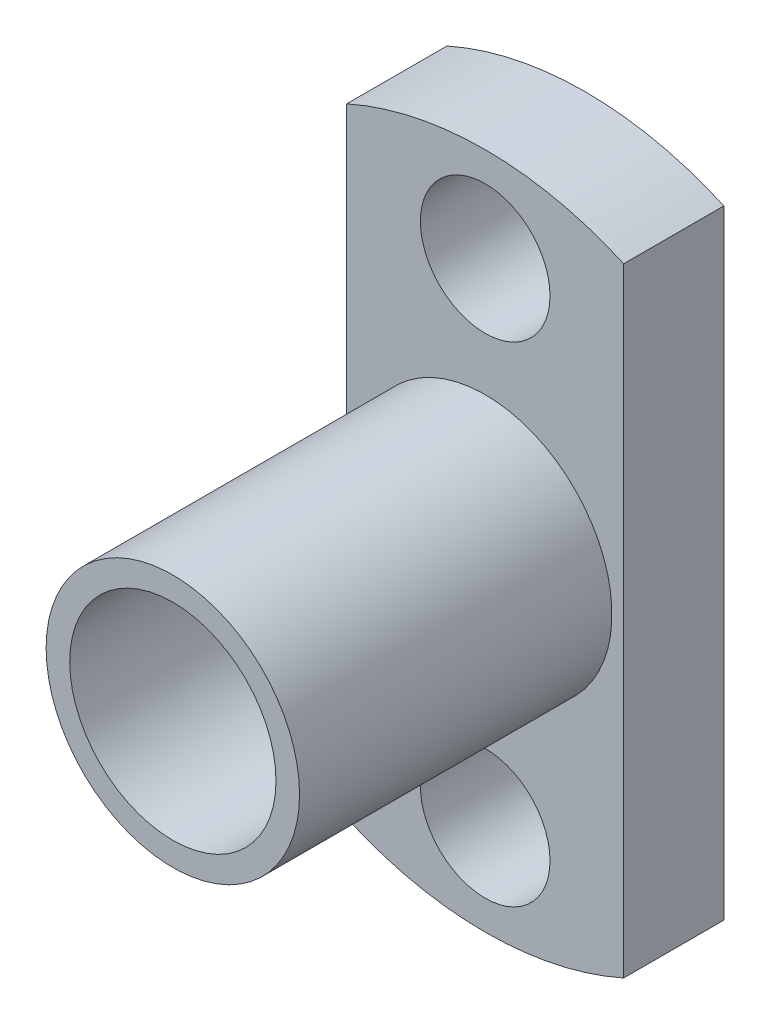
ISO-10303-21;
HEADER;
FILE_DESCRIPTION(('STEP AP214'),'2;1');
FILE_NAME('part.step','',(''),(''),'','','');
FILE_SCHEMA(('AUTOMOTIVE_DESIGN { 1 0 10303 214 1 1 1 1 }'));
ENDSEC;
DATA;
#1=APPLICATION_CONTEXT('core data for automotive mechanical design processes');
#2=APPLICATION_PROTOCOL_DEFINITION('international standard','automotive_design',2000,#1);
#3=PRODUCT_CONTEXT('',#1,'mechanical');
#4=PRODUCT('Part','Part','',(#3));
#5=PRODUCT_RELATED_PRODUCT_CATEGORY('part','',(#4));
#6=PRODUCT_DEFINITION_FORMATION('','',#4);
#7=PRODUCT_DEFINITION_CONTEXT('part definition',#1,'design');
#8=PRODUCT_DEFINITION('design','',#6,#7);
#9=PRODUCT_DEFINITION_SHAPE('','',#8);
#10=(LENGTH_UNIT() NAMED_UNIT(*) SI_UNIT(.MILLI.,.METRE.));
#11=(NAMED_UNIT(*) PLANE_ANGLE_UNIT() SI_UNIT($,.RADIAN.));
#12=(NAMED_UNIT(*) SI_UNIT($,.STERADIAN.) SOLID_ANGLE_UNIT());
#13=UNCERTAINTY_MEASURE_WITH_UNIT(LENGTH_MEASURE(1.E-05),#10,'distance_accuracy_value','');
#14=(GEOMETRIC_REPRESENTATION_CONTEXT(3) GLOBAL_UNCERTAINTY_ASSIGNED_CONTEXT((#13)) GLOBAL_UNIT_ASSIGNED_CONTEXT((#10,
#11,#12)) REPRESENTATION_CONTEXT('',''));
#15=CARTESIAN_POINT('',(0.,0.,0.));
#16=DIRECTION('',(0.,0.,1.));
#17=DIRECTION('',(1.,0.,0.));
#18=AXIS2_PLACEMENT_3D('',#15,#16,#17);
#19=CARTESIAN_POINT('',(0.,0.,3.7));
#20=DIRECTION('',(0.,0.,1.));
#21=DIRECTION('',(1.,0.,0.));
#22=AXIS2_PLACEMENT_3D('',#19,#20,#21);
#23=PLANE('',#22);
#24=CARTESIAN_POINT('',(0.,0.,3.7));
#25=DIRECTION('',(0.,0.,1.));
#26=DIRECTION('',(1.,0.,0.));
#27=AXIS2_PLACEMENT_3D('',#24,#25,#26);
#28=CIRCLE('',#27,1.75);
#29=CARTESIAN_POINT('',(1.75,0.,3.7));
#30=VERTEX_POINT('',#29);
#31=EDGE_CURVE('E119',#30,#30,#28,.T.);
#32=ORIENTED_EDGE('',*,*,#31,.T.);
#33=EDGE_LOOP('',(#32));
#34=FACE_BOUND('',#33,.T.);
#35=CARTESIAN_POINT('',(0.,0.,3.7));
#36=DIRECTION('',(0.,0.,1.));
#37=DIRECTION('',(1.,0.,0.));
#38=AXIS2_PLACEMENT_3D('',#35,#36,#37);
#39=CIRCLE('',#38,0.19);
#40=CARTESIAN_POINT('',(0.19,0.,3.7));
#41=VERTEX_POINT('',#40);
#42=EDGE_CURVE('E126',#41,#41,#39,.T.);
#43=ORIENTED_EDGE('',*,*,#42,.F.);
#44=EDGE_LOOP('',(#43));
#45=FACE_BOUND('',#44,.T.);
#46=ADVANCED_FACE('F35',(#34,#45),#23,.T.);
#47=CARTESIAN_POINT('',(0.,0.,1.7));
#48=DIRECTION('',(0.,0.,-1.));
#49=DIRECTION('',(-1.,0.,0.));
#50=AXIS2_PLACEMENT_3D('',#47,#48,#49);
#51=PLANE('',#50);
#52=CARTESIAN_POINT('',(0.,-4.15,1.7));
#53=DIRECTION('',(0.,0.,1.));
#54=DIRECTION('',(1.,0.,0.));
#55=AXIS2_PLACEMENT_3D('',#52,#53,#54);
#56=CIRCLE('',#55,1.1);
#57=CARTESIAN_POINT('',(1.1,-4.15,1.7));
#58=VERTEX_POINT('',#57);
#59=EDGE_CURVE('E138',#58,#58,#56,.T.);
#60=ORIENTED_EDGE('',*,*,#59,.F.);
#61=EDGE_LOOP('',(#60));
#62=FACE_BOUND('',#61,.T.);
#63=CARTESIAN_POINT('',(0.,4.15,1.7));
#64=DIRECTION('',(0.,0.,1.));
#65=DIRECTION('',(1.,0.,0.));
#66=AXIS2_PLACEMENT_3D('',#63,#64,#65);
#67=CIRCLE('',#66,1.1);
#68=CARTESIAN_POINT('',(1.1,4.15,1.7));
#69=VERTEX_POINT('',#68);
#70=EDGE_CURVE('E132',#69,#69,#67,.T.);
#71=ORIENTED_EDGE('',*,*,#70,.F.);
#72=EDGE_LOOP('',(#71));
#73=FACE_BOUND('',#72,.T.);
#74=CARTESIAN_POINT('',(0.,0.,1.7));
#75=DIRECTION('',(0.,0.,1.));
#76=DIRECTION('',(-1.,0.,0.));
#77=AXIS2_PLACEMENT_3D('',#74,#75,#76);
#78=CIRCLE('',#77,5.75000000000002);
#79=CARTESIAN_POINT('',(2.35,5.24785670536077,1.7));
#80=VERTEX_POINT('',#79);
#81=CARTESIAN_POINT('',(-2.35,5.24785670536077,1.7));
#82=VERTEX_POINT('',#81);
#83=EDGE_CURVE('E88',#80,#82,#78,.T.);
#84=ORIENTED_EDGE('',*,*,#83,.T.);
#85=DIRECTION('',(0.,-1.,0.));
#86=VECTOR('',#85,1.);
#87=CARTESIAN_POINT('',(-2.35,5.24785670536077,1.7));
#88=LINE('',#87,#86);
#89=CARTESIAN_POINT('',(-2.35,-5.24785670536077,1.7));
#90=VERTEX_POINT('',#89);
#91=EDGE_CURVE('E81',#82,#90,#88,.T.);
#92=ORIENTED_EDGE('',*,*,#91,.T.);
#93=CARTESIAN_POINT('',(0.,0.,1.7));
#94=DIRECTION('',(0.,0.,1.));
#95=DIRECTION('',(1.,0.,0.));
#96=AXIS2_PLACEMENT_3D('',#93,#94,#95);
#97=CIRCLE('',#96,5.75);
#98=CARTESIAN_POINT('',(2.35,-5.24785670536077,1.7));
#99=VERTEX_POINT('',#98);
#100=EDGE_CURVE('E85',#90,#99,#97,.T.);
#101=ORIENTED_EDGE('',*,*,#100,.T.);
#102=DIRECTION('',(0.,1.,0.));
#103=VECTOR('',#102,1.);
#104=CARTESIAN_POINT('',(2.35,0.,1.7));
#105=LINE('',#104,#103);
#106=EDGE_CURVE('E52',#99,#80,#105,.T.);
#107=ORIENTED_EDGE('',*,*,#106,.T.);
#108=EDGE_LOOP('',(#84,#92,#101,#107));
#109=FACE_BOUND('',#108,.T.);
#110=CARTESIAN_POINT('',(0.,0.,1.7));
#111=DIRECTION('',(0.,0.,-1.));
#112=DIRECTION('',(-1.,0.,0.));
#113=AXIS2_PLACEMENT_3D('',#110,#111,#112);
#114=CIRCLE('',#113,2.15);
#115=CARTESIAN_POINT('',(-2.15,0.,1.7));
#116=VERTEX_POINT('',#115);
#117=EDGE_CURVE('E11',#116,#116,#114,.F.);
#118=ORIENTED_EDGE('',*,*,#117,.F.);
#119=EDGE_LOOP('',(#118));
#120=FACE_BOUND('',#119,.T.);
#121=ADVANCED_FACE('F82',(#62,#73,#109,#120),#51,.F.);
#122=CARTESIAN_POINT('',(0.,0.,1.7));
#123=DIRECTION('',(0.,0.,-1.));
#124=DIRECTION('',(-1.,0.,0.));
#125=AXIS2_PLACEMENT_3D('',#122,#123,#124);
#126=CYLINDRICAL_SURFACE('',#125,5.75000000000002);
#127=CARTESIAN_POINT('',(0.,0.,0.));
#128=DIRECTION('',(0.,0.,1.));
#129=DIRECTION('',(-1.,0.,0.));
#130=AXIS2_PLACEMENT_3D('',#127,#128,#129);
#131=CIRCLE('',#130,5.75000000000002);
#132=CARTESIAN_POINT('',(2.35,5.24785670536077,0.));
#133=VERTEX_POINT('',#132);
#134=CARTESIAN_POINT('',(-2.35,5.24785670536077,0.));
#135=VERTEX_POINT('',#134);
#136=EDGE_CURVE('E104',#133,#135,#131,.T.);
#137=ORIENTED_EDGE('',*,*,#136,.T.);
#138=DIRECTION('',(0.,0.,-1.));
#139=VECTOR('',#138,1.);
#140=CARTESIAN_POINT('',(-2.35,5.24785670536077,1.7));
#141=LINE('',#140,#139);
#142=EDGE_CURVE('E44',#82,#135,#141,.T.);
#143=ORIENTED_EDGE('',*,*,#142,.F.);
#144=ORIENTED_EDGE('',*,*,#83,.F.);
#145=DIRECTION('',(0.,0.,-1.));
#146=VECTOR('',#145,1.);
#147=CARTESIAN_POINT('',(2.35,5.24785670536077,1.7));
#148=LINE('',#147,#146);
#149=EDGE_CURVE('E100',#80,#133,#148,.T.);
#150=ORIENTED_EDGE('',*,*,#149,.T.);
#151=EDGE_LOOP('',(#137,#143,#144,#150));
#152=FACE_BOUND('',#151,.T.);
#153=ADVANCED_FACE('F37',(#152),#126,.T.);
#154=CARTESIAN_POINT('',(-2.35,5.24785670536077,1.7));
#155=DIRECTION('',(1.,0.,0.));
#156=DIRECTION('',(0.,0.,-1.));
#157=AXIS2_PLACEMENT_3D('',#154,#155,#156);
#158=PLANE('',#157);
#159=DIRECTION('',(0.,-1.,0.));
#160=VECTOR('',#159,1.);
#161=CARTESIAN_POINT('',(-2.35,5.24785670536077,0.));
#162=LINE('',#161,#160);
#163=CARTESIAN_POINT('',(-2.35,-5.24785670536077,0.));
#164=VERTEX_POINT('',#163);
#165=EDGE_CURVE('E94',#135,#164,#162,.T.);
#166=ORIENTED_EDGE('',*,*,#165,.T.);
#167=DIRECTION('',(0.,0.,-1.));
#168=VECTOR('',#167,1.);
#169=CARTESIAN_POINT('',(-2.35,-5.24785670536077,1.7));
#170=LINE('',#169,#168);
#171=EDGE_CURVE('E92',#90,#164,#170,.T.);
#172=ORIENTED_EDGE('',*,*,#171,.F.);
#173=ORIENTED_EDGE('',*,*,#91,.F.);
#174=ORIENTED_EDGE('',*,*,#142,.T.);
#175=EDGE_LOOP('',(#166,#172,#173,#174));
#176=FACE_BOUND('',#175,.T.);
#177=ADVANCED_FACE('F93',(#176),#158,.F.);
#178=CARTESIAN_POINT('',(0.,0.,1.7));
#179=DIRECTION('',(0.,0.,-1.));
#180=DIRECTION('',(-1.,0.,0.));
#181=AXIS2_PLACEMENT_3D('',#178,#179,#180);
#182=CYLINDRICAL_SURFACE('',#181,5.75);
#183=CARTESIAN_POINT('',(0.,0.,0.));
#184=DIRECTION('',(0.,0.,1.));
#185=DIRECTION('',(1.,0.,0.));
#186=AXIS2_PLACEMENT_3D('',#183,#184,#185);
#187=CIRCLE('',#186,5.75);
#188=CARTESIAN_POINT('',(2.35,-5.24785670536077,0.));
#189=VERTEX_POINT('',#188);
#190=EDGE_CURVE('E109',#164,#189,#187,.T.);
#191=ORIENTED_EDGE('',*,*,#190,.T.);
#192=DIRECTION('',(0.,0.,-1.));
#193=VECTOR('',#192,1.);
#194=CARTESIAN_POINT('',(2.35,-5.24785670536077,1.7));
#195=LINE('',#194,#193);
#196=EDGE_CURVE('E96',#99,#189,#195,.T.);
#197=ORIENTED_EDGE('',*,*,#196,.F.);
#198=ORIENTED_EDGE('',*,*,#100,.F.);
#199=ORIENTED_EDGE('',*,*,#171,.T.);
#200=EDGE_LOOP('',(#191,#197,#198,#199));
#201=FACE_BOUND('',#200,.T.);
#202=ADVANCED_FACE('F98',(#201),#182,.T.);
#203=CARTESIAN_POINT('',(2.35,0.,1.7));
#204=DIRECTION('',(-1.,0.,0.));
#205=DIRECTION('',(0.,0.,1.));
#206=AXIS2_PLACEMENT_3D('',#203,#204,#205);
#207=PLANE('',#206);
#208=DIRECTION('',(0.,1.,0.));
#209=VECTOR('',#208,1.);
#210=CARTESIAN_POINT('',(2.35,0.,0.));
#211=LINE('',#210,#209);
#212=EDGE_CURVE('E69',#189,#133,#211,.T.);
#213=ORIENTED_EDGE('',*,*,#212,.T.);
#214=ORIENTED_EDGE('',*,*,#149,.F.);
#215=ORIENTED_EDGE('',*,*,#106,.F.);
#216=ORIENTED_EDGE('',*,*,#196,.T.);
#217=EDGE_LOOP('',(#213,#214,#215,#216));
#218=FACE_BOUND('',#217,.T.);
#219=ADVANCED_FACE('F115',(#218),#207,.F.);
#220=CARTESIAN_POINT('',(0.,0.,0.));
#221=DIRECTION('',(0.,0.,-1.));
#222=DIRECTION('',(-1.,0.,0.));
#223=AXIS2_PLACEMENT_3D('',#220,#221,#222);
#224=PLANE('',#223);
#225=CARTESIAN_POINT('',(0.,0.,0.));
#226=DIRECTION('',(0.,0.,-1.));
#227=DIRECTION('',(-1.,0.,0.));
#228=AXIS2_PLACEMENT_3D('',#225,#226,#227);
#229=CIRCLE('',#228,0.19);
#230=CARTESIAN_POINT('',(-0.19,0.,0.));
#231=VERTEX_POINT('',#230);
#232=EDGE_CURVE('E144',#231,#231,#229,.T.);
#233=ORIENTED_EDGE('',*,*,#232,.F.);
#234=EDGE_LOOP('',(#233));
#235=FACE_BOUND('',#234,.T.);
#236=CARTESIAN_POINT('',(0.,-4.15,0.));
#237=DIRECTION('',(0.,0.,1.));
#238=DIRECTION('',(1.,0.,0.));
#239=AXIS2_PLACEMENT_3D('',#236,#237,#238);
#240=CIRCLE('',#239,1.1);
#241=CARTESIAN_POINT('',(1.1,-4.15,0.));
#242=VERTEX_POINT('',#241);
#243=EDGE_CURVE('E135',#242,#242,#240,.T.);
#244=ORIENTED_EDGE('',*,*,#243,.T.);
#245=EDGE_LOOP('',(#244));
#246=FACE_BOUND('',#245,.T.);
#247=CARTESIAN_POINT('',(0.,4.15,0.));
#248=DIRECTION('',(0.,0.,1.));
#249=DIRECTION('',(1.,0.,0.));
#250=AXIS2_PLACEMENT_3D('',#247,#248,#249);
#251=CIRCLE('',#250,1.1);
#252=CARTESIAN_POINT('',(1.1,4.15,0.));
#253=VERTEX_POINT('',#252);
#254=EDGE_CURVE('E129',#253,#253,#251,.T.);
#255=ORIENTED_EDGE('',*,*,#254,.T.);
#256=EDGE_LOOP('',(#255));
#257=FACE_BOUND('',#256,.T.);
#258=ORIENTED_EDGE('',*,*,#136,.F.);
#259=ORIENTED_EDGE('',*,*,#212,.F.);
#260=ORIENTED_EDGE('',*,*,#190,.F.);
#261=ORIENTED_EDGE('',*,*,#165,.F.);
#262=EDGE_LOOP('',(#258,#259,#260,#261));
#263=FACE_BOUND('',#262,.T.);
#264=ADVANCED_FACE('F114',(#235,#246,#257,#263),#224,.T.);
#265=CARTESIAN_POINT('',(0.,0.,7.));
#266=DIRECTION('',(0.,0.,-1.));
#267=DIRECTION('',(-1.,0.,0.));
#268=AXIS2_PLACEMENT_3D('',#265,#266,#267);
#269=CYLINDRICAL_SURFACE('',#268,2.15);
#270=CARTESIAN_POINT('',(0.,0.,7.));
#271=DIRECTION('',(0.,0.,1.));
#272=DIRECTION('',(1.,0.,0.));
#273=AXIS2_PLACEMENT_3D('',#270,#271,#272);
#274=CIRCLE('',#273,2.15);
#275=CARTESIAN_POINT('',(2.15,0.,7.));
#276=VERTEX_POINT('',#275);
#277=EDGE_CURVE('E107',#276,#276,#274,.T.);
#278=ORIENTED_EDGE('',*,*,#277,.F.);
#279=EDGE_LOOP('',(#278));
#280=FACE_BOUND('',#279,.T.);
#281=ORIENTED_EDGE('',*,*,#117,.T.);
#282=EDGE_LOOP('',(#281));
#283=FACE_BOUND('',#282,.T.);
#284=ADVANCED_FACE('F161',(#280,#283),#269,.T.);
#285=CARTESIAN_POINT('',(0.,0.,7.));
#286=DIRECTION('',(0.,0.,1.));
#287=DIRECTION('',(1.,0.,0.));
#288=AXIS2_PLACEMENT_3D('',#285,#286,#287);
#289=PLANE('',#288);
#290=CARTESIAN_POINT('',(0.,0.,7.));
#291=DIRECTION('',(0.,0.,1.));
#292=DIRECTION('',(1.,0.,0.));
#293=AXIS2_PLACEMENT_3D('',#290,#291,#292);
#294=CIRCLE('',#293,1.75);
#295=CARTESIAN_POINT('',(1.75,0.,7.));
#296=VERTEX_POINT('',#295);
#297=EDGE_CURVE('E120',#296,#296,#294,.T.);
#298=ORIENTED_EDGE('',*,*,#297,.F.);
#299=EDGE_LOOP('',(#298));
#300=FACE_BOUND('',#299,.T.);
#301=ORIENTED_EDGE('',*,*,#277,.T.);
#302=EDGE_LOOP('',(#301));
#303=FACE_BOUND('',#302,.T.);
#304=ADVANCED_FACE('F215',(#300,#303),#289,.T.);
#305=CARTESIAN_POINT('',(0.,0.,3.7));
#306=DIRECTION('',(0.,0.,1.));
#307=DIRECTION('',(1.,0.,0.));
#308=AXIS2_PLACEMENT_3D('',#305,#306,#307);
#309=CYLINDRICAL_SURFACE('',#308,1.75);
#310=ORIENTED_EDGE('',*,*,#31,.F.);
#311=EDGE_LOOP('',(#310));
#312=FACE_BOUND('',#311,.T.);
#313=ORIENTED_EDGE('',*,*,#297,.T.);
#314=EDGE_LOOP('',(#313));
#315=FACE_BOUND('',#314,.T.);
#316=ADVANCED_FACE('F222',(#312,#315),#309,.F.);
#317=CARTESIAN_POINT('',(0.,0.,4.7));
#318=DIRECTION('',(0.,0.,-1.));
#319=DIRECTION('',(-1.,0.,0.));
#320=AXIS2_PLACEMENT_3D('',#317,#318,#319);
#321=CYLINDRICAL_SURFACE('',#320,0.19);
#322=CARTESIAN_POINT('',(0.,0.,4.7));
#323=DIRECTION('',(0.,0.,1.));
#324=DIRECTION('',(1.,0.,0.));
#325=AXIS2_PLACEMENT_3D('',#322,#323,#324);
#326=CIRCLE('',#325,0.19);
#327=CARTESIAN_POINT('',(0.19,0.,4.7));
#328=VERTEX_POINT('',#327);
#329=EDGE_CURVE('E123',#328,#328,#326,.T.);
#330=ORIENTED_EDGE('',*,*,#329,.F.);
#331=EDGE_LOOP('',(#330));
#332=FACE_BOUND('',#331,.T.);
#333=ORIENTED_EDGE('',*,*,#42,.T.);
#334=EDGE_LOOP('',(#333));
#335=FACE_BOUND('',#334,.T.);
#336=ADVANCED_FACE('F229',(#332,#335),#321,.T.);
#337=CARTESIAN_POINT('',(0.,0.,4.7));
#338=DIRECTION('',(0.,0.,1.));
#339=DIRECTION('',(1.,0.,0.));
#340=AXIS2_PLACEMENT_3D('',#337,#338,#339);
#341=PLANE('',#340);
#342=ORIENTED_EDGE('',*,*,#329,.T.);
#343=EDGE_LOOP('',(#342));
#344=FACE_BOUND('',#343,.T.);
#345=ADVANCED_FACE('F170',(#344),#341,.T.);
#346=CARTESIAN_POINT('',(0.,4.15,0.));
#347=DIRECTION('',(0.,0.,1.));
#348=DIRECTION('',(1.,0.,0.));
#349=AXIS2_PLACEMENT_3D('',#346,#347,#348);
#350=CYLINDRICAL_SURFACE('',#349,1.1);
#351=ORIENTED_EDGE('',*,*,#254,.F.);
#352=EDGE_LOOP('',(#351));
#353=FACE_BOUND('',#352,.T.);
#354=ORIENTED_EDGE('',*,*,#70,.T.);
#355=EDGE_LOOP('',(#354));
#356=FACE_BOUND('',#355,.T.);
#357=ADVANCED_FACE('F167',(#353,#356),#350,.F.);
#358=CARTESIAN_POINT('',(0.,-4.15,0.));
#359=DIRECTION('',(0.,0.,1.));
#360=DIRECTION('',(1.,0.,0.));
#361=AXIS2_PLACEMENT_3D('',#358,#359,#360);
#362=CYLINDRICAL_SURFACE('',#361,1.1);
#363=ORIENTED_EDGE('',*,*,#243,.F.);
#364=EDGE_LOOP('',(#363));
#365=FACE_BOUND('',#364,.T.);
#366=ORIENTED_EDGE('',*,*,#59,.T.);
#367=EDGE_LOOP('',(#366));
#368=FACE_BOUND('',#367,.T.);
#369=ADVANCED_FACE('F155',(#365,#368),#362,.F.);
#370=CARTESIAN_POINT('',(0.,0.,1.));
#371=DIRECTION('',(0.,0.,-1.));
#372=DIRECTION('',(-1.,0.,0.));
#373=AXIS2_PLACEMENT_3D('',#370,#371,#372);
#374=CYLINDRICAL_SURFACE('',#373,0.19);
#375=CARTESIAN_POINT('',(0.,0.,1.));
#376=DIRECTION('',(0.,0.,-1.));
#377=DIRECTION('',(-1.,0.,0.));
#378=AXIS2_PLACEMENT_3D('',#375,#376,#377);
#379=CIRCLE('',#378,0.19);
#380=CARTESIAN_POINT('',(-0.19,0.,1.));
#381=VERTEX_POINT('',#380);
#382=EDGE_CURVE('E141',#381,#381,#379,.T.);
#383=ORIENTED_EDGE('',*,*,#382,.F.);
#384=EDGE_LOOP('',(#383));
#385=FACE_BOUND('',#384,.T.);
#386=ORIENTED_EDGE('',*,*,#232,.T.);
#387=EDGE_LOOP('',(#386));
#388=FACE_BOUND('',#387,.T.);
#389=ADVANCED_FACE('F152',(#385,#388),#374,.F.);
#390=CARTESIAN_POINT('',(0.,0.,1.));
#391=DIRECTION('',(0.,0.,-1.));
#392=DIRECTION('',(-1.,0.,0.));
#393=AXIS2_PLACEMENT_3D('',#390,#391,#392);
#394=PLANE('',#393);
#395=ORIENTED_EDGE('',*,*,#382,.T.);
#396=EDGE_LOOP('',(#395));
#397=FACE_BOUND('',#396,.T.);
#398=ADVANCED_FACE('F150',(#397),#394,.T.);
#399=CLOSED_SHELL('',(#46,#121,#153,#177,#202,#219,#264,#284,#304,#316,#336,#345,#357,#369,#389,#398));
#400=MANIFOLD_SOLID_BREP('B2',#399);
#401=ADVANCED_BREP_SHAPE_REPRESENTATION('',(#18,#400),#14);
#402=SHAPE_DEFINITION_REPRESENTATION(#9,#401);
ENDSEC;
END-ISO-10303-21;
